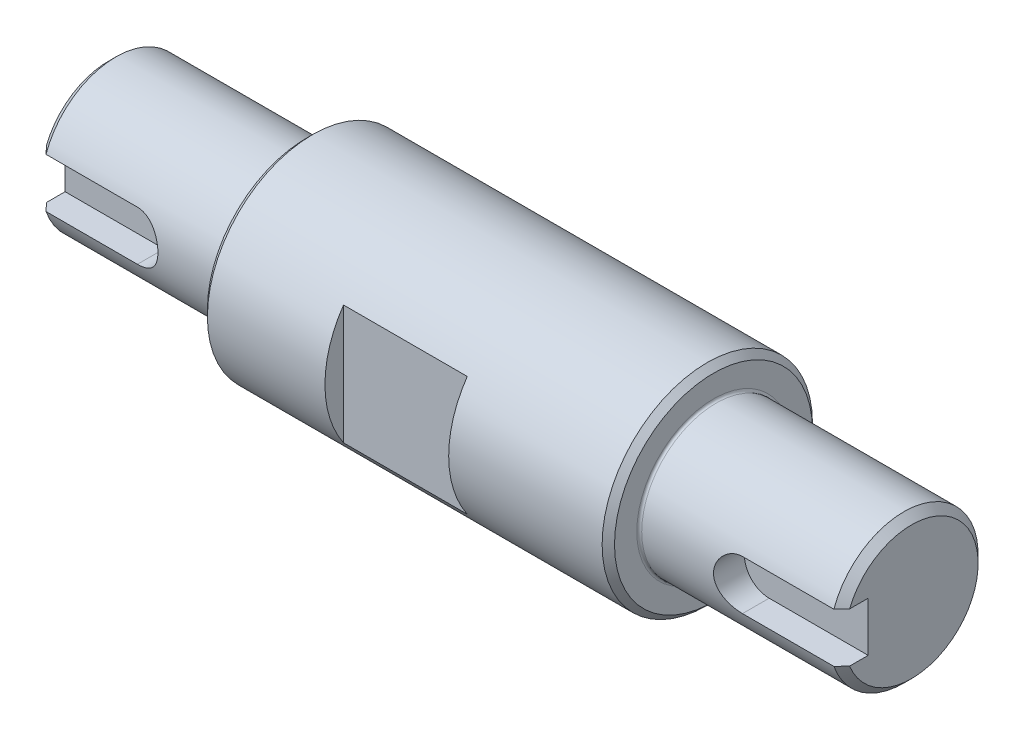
from build123d import *

# Parameters (mm, degrees)
CUT_EXTRUDE1_DEPTH = 10
CUT_EXTRUDE2_DEPTH = 2.5
CUT_EXTRUDE3_DEPTH = 2.5


with BuildPart() as part:
    # Sketch1 → Revolve1 (revolve)
    with BuildSketch(Plane.XY, mode=Mode.PRIVATE) as revolve1_sk:
        with BuildLine():
            Line((-16, 0), (-16, 5.3865))
            Line((-16, 5.3865), (-15.3865, 6))
            Line((-15.3865, 6), (-0.2, 6))
            ThreePointArc((-0.2, 6), (-0.058578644, 6.058578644), (0, 6.2))
            Line((0, 6.2), (0, 8))
            Line((0, 8), (0.5, 8.5))
            Line((0.5, 8.5), (32.4, 8.5))
            Line((32.4, 8.5), (32.9, 8))
            Line((32.9, 8), (32.9, 6.2))
            ThreePointArc((32.9, 6.2), (32.958578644, 6.058578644), (33.1, 6))
            Line((33.1, 6), (48.2865, 6))
            Line((48.2865, 6), (48.9, 5.3865))
            Line((48.9, 5.3865), (48.9, 0))
            Line((48.9, 0), (-16, 0))
        make_face()
    revolve(revolve1_sk.sketch.rotate(Axis((48.9, 0, 0), (-1, 0, 0)), 270), axis=Axis((48.9, 0, 0), (-1, 0, 0)))

    # Sketch2 → Cut-Extrude1 (cut)
    with BuildSketch(Plane(origin=(10, 0, 0), x_dir=(0, 0, -1), z_dir=(1, 0, 0))):
        Polygon((-14, 8.5), (-14, -17), (14, -17), (14, 8.5), (7, 8.5), (7, -8.5), (-7, -8.5), (-7, 8.5), align=None)
    extrude(amount=CUT_EXTRUDE1_DEPTH, mode=Mode.SUBTRACT)

    # Sketch3 → Cut-Extrude2 (cut)
    with BuildSketch(Plane.XY.offset(6)):
        with BuildLine():
            Line((-17, -2), (-8, -2))
            ThreePointArc((-8, -2), (-6, 0), (-8, 2))
            Line((-8, 2), (-17, 2))
            Line((-17, 2), (-17, -2))
        make_face()
    extrude(amount=-CUT_EXTRUDE2_DEPTH, mode=Mode.SUBTRACT)

    # Sketch4 → Cut-Extrude3 (cut)
    with BuildSketch(Plane.XY.offset(6)):
        with BuildLine():
            Line((40.9, -2), (49.9, -2))
            Line((49.9, -2), (49.9, 2))
            Line((49.9, 2), (40.9, 2))
            ThreePointArc((40.9, 2), (38.9, 0), (40.9, -2))
        make_face()
    extrude(amount=-CUT_EXTRUDE3_DEPTH, mode=Mode.SUBTRACT)


solid = part.part
